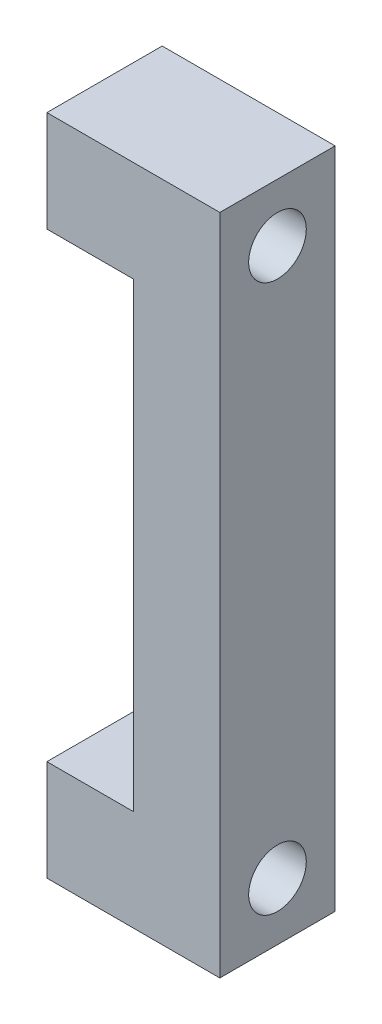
from build123d import *

# Parameters (mm, degrees)
BOSS_EXTRUDE2_DEPTH = 6.35
SKETCH7_R           = 3.175
CUT_EXTRUDE3_DEPTH  = 25.4


with BuildPart() as part:
    # Sketch5 → Boss-Extrude2 (new, symmetric)
    with BuildSketch(Plane.XY):
        Polygon((-19.05, -36.5125), (0, -36.5125), (0, 0), (0, 36.5125), (-19.05, 36.5125), (-19.05, 25.4), (-9.525, 25.4), (-9.525, -25.4), (-19.05, -25.4), align=None)
    extrude(amount=BOSS_EXTRUDE2_DEPTH, both=True)

    # Sketch7 → Cut-Extrude3 (cut)
    with BuildSketch(Plane(origin=(0, 0, 0), x_dir=(0, 0, -1), z_dir=(1, 0, 0))):
        with Locations((0, 30.1625)):
            Circle(SKETCH7_R)
        with Locations((0, -30.1625)):
            Circle(SKETCH7_R)
    extrude(amount=-CUT_EXTRUDE3_DEPTH, mode=Mode.SUBTRACT)


solid = part.part
